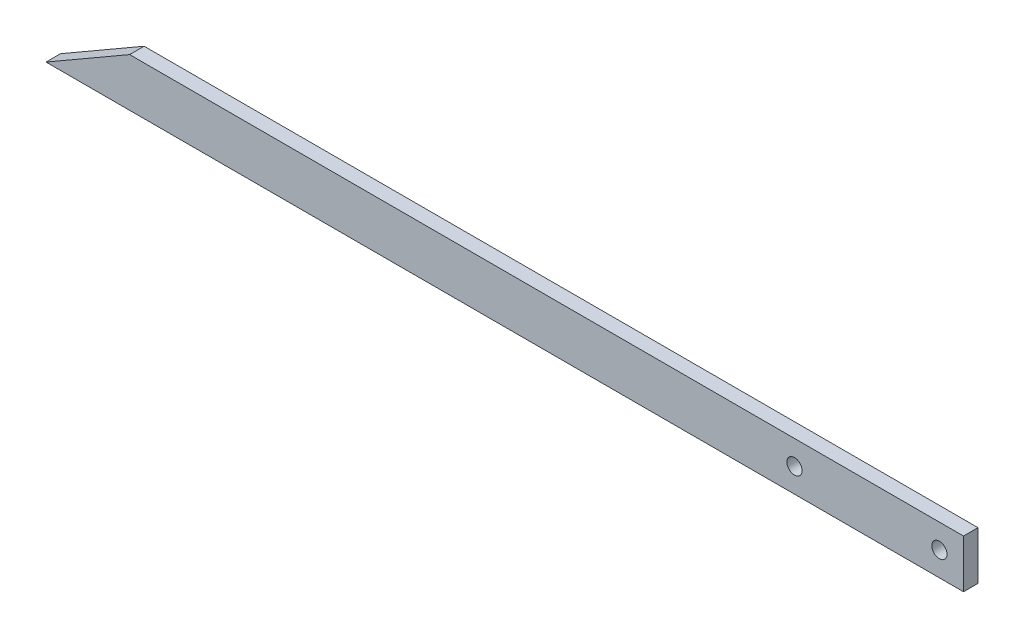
ISO-10303-21;
HEADER;
FILE_DESCRIPTION(('STEP AP214'),'2;1');
FILE_NAME('part.step','',(''),(''),'','','');
FILE_SCHEMA(('AUTOMOTIVE_DESIGN { 1 0 10303 214 1 1 1 1 }'));
ENDSEC;
DATA;
#1=APPLICATION_CONTEXT('core data for automotive mechanical design processes');
#2=APPLICATION_PROTOCOL_DEFINITION('international standard','automotive_design',2000,#1);
#3=PRODUCT_CONTEXT('',#1,'mechanical');
#4=PRODUCT('Part','Part','',(#3));
#5=PRODUCT_RELATED_PRODUCT_CATEGORY('part','',(#4));
#6=PRODUCT_DEFINITION_FORMATION('','',#4);
#7=PRODUCT_DEFINITION_CONTEXT('part definition',#1,'design');
#8=PRODUCT_DEFINITION('design','',#6,#7);
#9=PRODUCT_DEFINITION_SHAPE('','',#8);
#10=(LENGTH_UNIT() NAMED_UNIT(*) SI_UNIT(.MILLI.,.METRE.));
#11=(NAMED_UNIT(*) PLANE_ANGLE_UNIT() SI_UNIT($,.RADIAN.));
#12=(NAMED_UNIT(*) SI_UNIT($,.STERADIAN.) SOLID_ANGLE_UNIT());
#13=UNCERTAINTY_MEASURE_WITH_UNIT(LENGTH_MEASURE(1.E-05),#10,'distance_accuracy_value','');
#14=(GEOMETRIC_REPRESENTATION_CONTEXT(3) GLOBAL_UNCERTAINTY_ASSIGNED_CONTEXT((#13)) GLOBAL_UNIT_ASSIGNED_CONTEXT((#10,
#11,#12)) REPRESENTATION_CONTEXT('',''));
#15=CARTESIAN_POINT('',(0.,0.,0.));
#16=DIRECTION('',(0.,0.,1.));
#17=DIRECTION('',(1.,0.,0.));
#18=AXIS2_PLACEMENT_3D('',#15,#16,#17);
#19=CARTESIAN_POINT('',(0.,0.,7.62));
#20=DIRECTION('',(0.,1.,0.));
#21=DIRECTION('',(0.,0.,1.));
#22=AXIS2_PLACEMENT_3D('',#19,#20,#21);
#23=PLANE('',#22);
#24=DIRECTION('',(1.,0.,0.));
#25=VECTOR('',#24,1.);
#26=CARTESIAN_POINT('',(0.,0.,0.));
#27=LINE('',#26,#25);
#28=CARTESIAN_POINT('',(0.,0.,0.));
#29=VERTEX_POINT('',#28);
#30=CARTESIAN_POINT('',(482.6,0.,0.));
#31=VERTEX_POINT('',#30);
#32=EDGE_CURVE('E111',#29,#31,#27,.T.);
#33=ORIENTED_EDGE('',*,*,#32,.T.);
#34=DIRECTION('',(0.,0.,-1.));
#35=VECTOR('',#34,1.);
#36=CARTESIAN_POINT('',(482.6,0.,7.62));
#37=LINE('',#36,#35);
#38=CARTESIAN_POINT('',(482.6,0.,7.62));
#39=VERTEX_POINT('',#38);
#40=EDGE_CURVE('E11',#39,#31,#37,.T.);
#41=ORIENTED_EDGE('',*,*,#40,.F.);
#42=DIRECTION('',(1.,0.,0.));
#43=VECTOR('',#42,1.);
#44=CARTESIAN_POINT('',(0.,0.,7.62));
#45=LINE('',#44,#43);
#46=CARTESIAN_POINT('',(0.,0.,7.62));
#47=VERTEX_POINT('',#46);
#48=EDGE_CURVE('E95',#47,#39,#45,.T.);
#49=ORIENTED_EDGE('',*,*,#48,.F.);
#50=DIRECTION('',(0.,0.,-1.));
#51=VECTOR('',#50,1.);
#52=CARTESIAN_POINT('',(0.,0.,7.62));
#53=LINE('',#52,#51);
#54=EDGE_CURVE('E107',#47,#29,#53,.T.);
#55=ORIENTED_EDGE('',*,*,#54,.T.);
#56=EDGE_LOOP('',(#33,#41,#49,#55));
#57=FACE_BOUND('',#56,.T.);
#58=ADVANCED_FACE('F43',(#57),#23,.F.);
#59=CARTESIAN_POINT('',(482.6,0.,7.62));
#60=DIRECTION('',(-1.,0.,0.));
#61=DIRECTION('',(0.,0.,1.));
#62=AXIS2_PLACEMENT_3D('',#59,#60,#61);
#63=PLANE('',#62);
#64=DIRECTION('',(0.,1.,0.));
#65=VECTOR('',#64,1.);
#66=CARTESIAN_POINT('',(482.6,0.,0.));
#67=LINE('',#66,#65);
#68=CARTESIAN_POINT('',(482.6,25.4,0.));
#69=VERTEX_POINT('',#68);
#70=EDGE_CURVE('E100',#31,#69,#67,.T.);
#71=ORIENTED_EDGE('',*,*,#70,.T.);
#72=DIRECTION('',(0.,0.,-1.));
#73=VECTOR('',#72,1.);
#74=CARTESIAN_POINT('',(482.6,25.4,7.62));
#75=LINE('',#74,#73);
#76=CARTESIAN_POINT('',(482.6,25.4,7.62));
#77=VERTEX_POINT('',#76);
#78=EDGE_CURVE('E52',#77,#69,#75,.T.);
#79=ORIENTED_EDGE('',*,*,#78,.F.);
#80=DIRECTION('',(0.,1.,0.));
#81=VECTOR('',#80,1.);
#82=CARTESIAN_POINT('',(482.6,0.,7.62));
#83=LINE('',#82,#81);
#84=EDGE_CURVE('E90',#39,#77,#83,.T.);
#85=ORIENTED_EDGE('',*,*,#84,.F.);
#86=ORIENTED_EDGE('',*,*,#40,.T.);
#87=EDGE_LOOP('',(#71,#79,#85,#86));
#88=FACE_BOUND('',#87,.T.);
#89=ADVANCED_FACE('F99',(#88),#63,.F.);
#90=CARTESIAN_POINT('',(43.9940905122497,25.4,7.62));
#91=DIRECTION('',(0.,-1.,0.));
#92=DIRECTION('',(0.,0.,-1.));
#93=AXIS2_PLACEMENT_3D('',#90,#91,#92);
#94=PLANE('',#93);
#95=DIRECTION('',(-1.,0.,0.));
#96=VECTOR('',#95,1.);
#97=CARTESIAN_POINT('',(43.9940905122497,25.4,0.));
#98=LINE('',#97,#96);
#99=CARTESIAN_POINT('',(43.9940905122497,25.4,0.));
#100=VERTEX_POINT('',#99);
#101=EDGE_CURVE('E77',#69,#100,#98,.T.);
#102=ORIENTED_EDGE('',*,*,#101,.T.);
#103=DIRECTION('',(0.,0.,-1.));
#104=VECTOR('',#103,1.);
#105=CARTESIAN_POINT('',(43.9940905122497,25.4,7.62));
#106=LINE('',#105,#104);
#107=CARTESIAN_POINT('',(43.9940905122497,25.4,7.62));
#108=VERTEX_POINT('',#107);
#109=EDGE_CURVE('E102',#108,#100,#106,.T.);
#110=ORIENTED_EDGE('',*,*,#109,.F.);
#111=DIRECTION('',(-1.,0.,0.));
#112=VECTOR('',#111,1.);
#113=CARTESIAN_POINT('',(43.9940905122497,25.4,7.62));
#114=LINE('',#113,#112);
#115=EDGE_CURVE('E93',#77,#108,#114,.T.);
#116=ORIENTED_EDGE('',*,*,#115,.F.);
#117=ORIENTED_EDGE('',*,*,#78,.T.);
#118=EDGE_LOOP('',(#102,#110,#116,#117));
#119=FACE_BOUND('',#118,.T.);
#120=ADVANCED_FACE('F103',(#119),#94,.F.);
#121=CARTESIAN_POINT('',(0.,0.,7.62));
#122=DIRECTION('',(0.499999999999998,-0.86602540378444,0.));
#123=DIRECTION('',(0.86602540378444,0.499999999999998,0.));
#124=AXIS2_PLACEMENT_3D('',#121,#122,#123);
#125=PLANE('',#124);
#126=DIRECTION('',(-0.86602540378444,-0.499999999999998,0.));
#127=VECTOR('',#126,1.);
#128=CARTESIAN_POINT('',(0.,0.,0.));
#129=LINE('',#128,#127);
#130=EDGE_CURVE('E83',#100,#29,#129,.T.);
#131=ORIENTED_EDGE('',*,*,#130,.T.);
#132=ORIENTED_EDGE('',*,*,#54,.F.);
#133=DIRECTION('',(-0.86602540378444,-0.499999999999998,0.));
#134=VECTOR('',#133,1.);
#135=CARTESIAN_POINT('',(0.,0.,7.62));
#136=LINE('',#135,#134);
#137=EDGE_CURVE('E60',#108,#47,#136,.T.);
#138=ORIENTED_EDGE('',*,*,#137,.F.);
#139=ORIENTED_EDGE('',*,*,#109,.T.);
#140=EDGE_LOOP('',(#131,#132,#138,#139));
#141=FACE_BOUND('',#140,.T.);
#142=ADVANCED_FACE('F125',(#141),#125,.F.);
#143=CARTESIAN_POINT('',(0.,0.,7.62));
#144=DIRECTION('',(0.,0.,1.));
#145=DIRECTION('',(1.,0.,0.));
#146=AXIS2_PLACEMENT_3D('',#143,#144,#145);
#147=PLANE('',#146);
#148=CARTESIAN_POINT('',(469.9,12.7,7.62));
#149=DIRECTION('',(0.,0.,1.));
#150=DIRECTION('',(1.,0.,0.));
#151=AXIS2_PLACEMENT_3D('',#148,#149,#150);
#152=CIRCLE('',#151,3.99999999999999);
#153=CARTESIAN_POINT('',(473.9,12.7,7.62));
#154=VERTEX_POINT('',#153);
#155=EDGE_CURVE('E140',#154,#154,#152,.T.);
#156=ORIENTED_EDGE('',*,*,#155,.F.);
#157=EDGE_LOOP('',(#156));
#158=FACE_BOUND('',#157,.T.);
#159=CARTESIAN_POINT('',(393.7,12.7,7.62));
#160=DIRECTION('',(0.,0.,1.));
#161=DIRECTION('',(1.,0.,0.));
#162=AXIS2_PLACEMENT_3D('',#159,#160,#161);
#163=CIRCLE('',#162,3.99999999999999);
#164=CARTESIAN_POINT('',(397.7,12.7,7.62));
#165=VERTEX_POINT('',#164);
#166=EDGE_CURVE('E136',#165,#165,#163,.T.);
#167=ORIENTED_EDGE('',*,*,#166,.F.);
#168=EDGE_LOOP('',(#167));
#169=FACE_BOUND('',#168,.T.);
#170=ORIENTED_EDGE('',*,*,#48,.T.);
#171=ORIENTED_EDGE('',*,*,#84,.T.);
#172=ORIENTED_EDGE('',*,*,#115,.T.);
#173=ORIENTED_EDGE('',*,*,#137,.T.);
#174=EDGE_LOOP('',(#170,#171,#172,#173));
#175=FACE_BOUND('',#174,.T.);
#176=ADVANCED_FACE('F91',(#158,#169,#175),#147,.T.);
#177=CARTESIAN_POINT('',(0.,0.,0.));
#178=DIRECTION('',(0.,0.,1.));
#179=DIRECTION('',(1.,0.,0.));
#180=AXIS2_PLACEMENT_3D('',#177,#178,#179);
#181=PLANE('',#180);
#182=CARTESIAN_POINT('',(469.9,12.7,0.));
#183=DIRECTION('',(0.,0.,1.));
#184=DIRECTION('',(1.,0.,0.));
#185=AXIS2_PLACEMENT_3D('',#182,#183,#184);
#186=CIRCLE('',#185,3.99999999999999);
#187=CARTESIAN_POINT('',(473.9,12.7,0.));
#188=VERTEX_POINT('',#187);
#189=EDGE_CURVE('E115',#188,#188,#186,.T.);
#190=ORIENTED_EDGE('',*,*,#189,.T.);
#191=EDGE_LOOP('',(#190));
#192=FACE_BOUND('',#191,.T.);
#193=CARTESIAN_POINT('',(393.7,12.7,0.));
#194=DIRECTION('',(0.,0.,1.));
#195=DIRECTION('',(1.,0.,0.));
#196=AXIS2_PLACEMENT_3D('',#193,#194,#195);
#197=CIRCLE('',#196,3.99999999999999);
#198=CARTESIAN_POINT('',(397.7,12.7,0.));
#199=VERTEX_POINT('',#198);
#200=EDGE_CURVE('E132',#199,#199,#197,.T.);
#201=ORIENTED_EDGE('',*,*,#200,.T.);
#202=EDGE_LOOP('',(#201));
#203=FACE_BOUND('',#202,.T.);
#204=ORIENTED_EDGE('',*,*,#32,.F.);
#205=ORIENTED_EDGE('',*,*,#130,.F.);
#206=ORIENTED_EDGE('',*,*,#101,.F.);
#207=ORIENTED_EDGE('',*,*,#70,.F.);
#208=EDGE_LOOP('',(#204,#205,#206,#207));
#209=FACE_BOUND('',#208,.T.);
#210=ADVANCED_FACE('F128',(#192,#203,#209),#181,.F.);
#211=CARTESIAN_POINT('',(393.7,12.7,0.));
#212=DIRECTION('',(0.,0.,1.));
#213=DIRECTION('',(1.,0.,0.));
#214=AXIS2_PLACEMENT_3D('',#211,#212,#213);
#215=CYLINDRICAL_SURFACE('',#214,3.99999999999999);
#216=CARTESIAN_POINT('',(397.7,12.7,0.));
#217=CARTESIAN_POINT('',(397.7,12.7,0.0793749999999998));
#218=CARTESIAN_POINT('',(397.7,12.7,0.15875));
#219=CARTESIAN_POINT('',(397.7,12.7,0.3175));
#220=CARTESIAN_POINT('',(397.7,12.7,0.396875));
#221=CARTESIAN_POINT('',(397.7,12.7,0.555625));
#222=CARTESIAN_POINT('',(397.7,12.7,0.635));
#223=CARTESIAN_POINT('',(397.7,12.7,0.79375));
#224=CARTESIAN_POINT('',(397.7,12.7,0.873125));
#225=CARTESIAN_POINT('',(397.7,12.7,1.031875));
#226=CARTESIAN_POINT('',(397.7,12.7,1.11125));
#227=CARTESIAN_POINT('',(397.7,12.7,1.27));
#228=CARTESIAN_POINT('',(397.7,12.7,1.349375));
#229=CARTESIAN_POINT('',(397.7,12.7,1.508125));
#230=CARTESIAN_POINT('',(397.7,12.7,1.5875));
#231=CARTESIAN_POINT('',(397.7,12.7,1.74625));
#232=CARTESIAN_POINT('',(397.7,12.7,1.825625));
#233=CARTESIAN_POINT('',(397.7,12.7,1.984375));
#234=CARTESIAN_POINT('',(397.7,12.7,2.06375));
#235=CARTESIAN_POINT('',(397.7,12.7,2.2225));
#236=CARTESIAN_POINT('',(397.7,12.7,2.301875));
#237=CARTESIAN_POINT('',(397.7,12.7,2.460625));
#238=CARTESIAN_POINT('',(397.7,12.7,2.54));
#239=CARTESIAN_POINT('',(397.7,12.7,2.69875));
#240=CARTESIAN_POINT('',(397.7,12.7,2.778125));
#241=CARTESIAN_POINT('',(397.7,12.7,2.936875));
#242=CARTESIAN_POINT('',(397.7,12.7,3.01625));
#243=CARTESIAN_POINT('',(397.7,12.7,3.175));
#244=CARTESIAN_POINT('',(397.7,12.7,3.254375));
#245=CARTESIAN_POINT('',(397.7,12.7,3.413125));
#246=CARTESIAN_POINT('',(397.7,12.7,3.4925));
#247=CARTESIAN_POINT('',(397.7,12.7,3.65125));
#248=CARTESIAN_POINT('',(397.7,12.7,3.730625));
#249=CARTESIAN_POINT('',(397.7,12.7,3.889375));
#250=CARTESIAN_POINT('',(397.7,12.7,3.96875));
#251=CARTESIAN_POINT('',(397.7,12.7,4.1275));
#252=CARTESIAN_POINT('',(397.7,12.7,4.206875));
#253=CARTESIAN_POINT('',(397.7,12.7,4.365625));
#254=CARTESIAN_POINT('',(397.7,12.7,4.445));
#255=CARTESIAN_POINT('',(397.7,12.7,4.60375));
#256=CARTESIAN_POINT('',(397.7,12.7,4.683125));
#257=CARTESIAN_POINT('',(397.7,12.7,4.841875));
#258=CARTESIAN_POINT('',(397.7,12.7,4.92125));
#259=CARTESIAN_POINT('',(397.7,12.7,5.08));
#260=CARTESIAN_POINT('',(397.7,12.7,5.159375));
#261=CARTESIAN_POINT('',(397.7,12.7,5.318125));
#262=CARTESIAN_POINT('',(397.7,12.7,5.3975));
#263=CARTESIAN_POINT('',(397.7,12.7,5.55625));
#264=CARTESIAN_POINT('',(397.7,12.7,5.635625));
#265=CARTESIAN_POINT('',(397.7,12.7,5.794375));
#266=CARTESIAN_POINT('',(397.7,12.7,5.87375));
#267=CARTESIAN_POINT('',(397.7,12.7,6.0325));
#268=CARTESIAN_POINT('',(397.7,12.7,6.111875));
#269=CARTESIAN_POINT('',(397.7,12.7,6.270625));
#270=CARTESIAN_POINT('',(397.7,12.7,6.35));
#271=CARTESIAN_POINT('',(397.7,12.7,6.50875));
#272=CARTESIAN_POINT('',(397.7,12.7,6.588125));
#273=CARTESIAN_POINT('',(397.7,12.7,6.746875));
#274=CARTESIAN_POINT('',(397.7,12.7,6.82625));
#275=CARTESIAN_POINT('',(397.7,12.7,6.985));
#276=CARTESIAN_POINT('',(397.7,12.7,7.064375));
#277=CARTESIAN_POINT('',(397.7,12.7,7.223125));
#278=CARTESIAN_POINT('',(397.7,12.7,7.3025));
#279=CARTESIAN_POINT('',(397.7,12.7,7.46125));
#280=CARTESIAN_POINT('',(397.7,12.7,7.540625));
#281=CARTESIAN_POINT('',(397.7,12.7,7.62));
#282=B_SPLINE_CURVE_WITH_KNOTS('',3,(#216,#217,#218,#219,#220,#221,#222,#223,#224,#225,#226,
#227,#228,#229,#230,#231,#232,#233,#234,#235,#236,#237,#238,#239,#240,#241,#242,#243,#244,#245,
#246,#247,#248,#249,#250,#251,#252,#253,#254,#255,#256,#257,#258,#259,#260,#261,#262,#263,#264,
#265,#266,#267,#268,#269,#270,#271,#272,#273,#274,#275,#276,#277,#278,#279,#280,#281),
.UNSPECIFIED.,.F.,.F.,(4,2,2,2,2,2,2,2,2,2,2,2,2,2,2,2,2,2,2,2,2,2,2,2,2,2,2,2,2,2,2,2,4),(0.,
0.238125,0.47625,0.714375,0.9525,1.190625,1.42875,1.666875,1.905,2.143125,2.38125,2.619375,
2.8575,3.095625,3.33375,3.571875,3.81,4.048125,4.28625,4.524375,4.7625,5.000625,5.23875,
5.476875,5.715,5.953125,6.19125,6.429375,6.6675,6.905625,7.14375,7.381875,7.62),.UNSPECIFIED.);
#283=EDGE_CURVE('BSEAM153',#199,#165,#282,.T.);
#284=ORIENTED_EDGE('',*,*,#200,.F.);
#285=ORIENTED_EDGE('',*,*,#166,.T.);
#286=ORIENTED_EDGE('',*,*,#283,.T.);
#287=ORIENTED_EDGE('',*,*,#283,.F.);
#288=EDGE_LOOP('',(#284,#286,#285,#287));
#289=FACE_BOUND('',#288,.T.);
#290=ADVANCED_FACE('F153',(#289),#215,.F.);
#291=CARTESIAN_POINT('',(469.9,12.7,0.));
#292=DIRECTION('',(0.,0.,1.));
#293=DIRECTION('',(1.,0.,0.));
#294=AXIS2_PLACEMENT_3D('',#291,#292,#293);
#295=CYLINDRICAL_SURFACE('',#294,3.99999999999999);
#296=CARTESIAN_POINT('',(473.9,12.7,0.));
#297=CARTESIAN_POINT('',(473.9,12.7,0.0793749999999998));
#298=CARTESIAN_POINT('',(473.9,12.7,0.15875));
#299=CARTESIAN_POINT('',(473.9,12.7,0.3175));
#300=CARTESIAN_POINT('',(473.9,12.7,0.396875));
#301=CARTESIAN_POINT('',(473.9,12.7,0.555625));
#302=CARTESIAN_POINT('',(473.9,12.7,0.635));
#303=CARTESIAN_POINT('',(473.9,12.7,0.79375));
#304=CARTESIAN_POINT('',(473.9,12.7,0.873125));
#305=CARTESIAN_POINT('',(473.9,12.7,1.031875));
#306=CARTESIAN_POINT('',(473.9,12.7,1.11125));
#307=CARTESIAN_POINT('',(473.9,12.7,1.27));
#308=CARTESIAN_POINT('',(473.9,12.7,1.349375));
#309=CARTESIAN_POINT('',(473.9,12.7,1.508125));
#310=CARTESIAN_POINT('',(473.9,12.7,1.5875));
#311=CARTESIAN_POINT('',(473.9,12.7,1.74625));
#312=CARTESIAN_POINT('',(473.9,12.7,1.825625));
#313=CARTESIAN_POINT('',(473.9,12.7,1.984375));
#314=CARTESIAN_POINT('',(473.9,12.7,2.06375));
#315=CARTESIAN_POINT('',(473.9,12.7,2.2225));
#316=CARTESIAN_POINT('',(473.9,12.7,2.301875));
#317=CARTESIAN_POINT('',(473.9,12.7,2.460625));
#318=CARTESIAN_POINT('',(473.9,12.7,2.54));
#319=CARTESIAN_POINT('',(473.9,12.7,2.69875));
#320=CARTESIAN_POINT('',(473.9,12.7,2.778125));
#321=CARTESIAN_POINT('',(473.9,12.7,2.936875));
#322=CARTESIAN_POINT('',(473.9,12.7,3.01625));
#323=CARTESIAN_POINT('',(473.9,12.7,3.175));
#324=CARTESIAN_POINT('',(473.9,12.7,3.254375));
#325=CARTESIAN_POINT('',(473.9,12.7,3.413125));
#326=CARTESIAN_POINT('',(473.9,12.7,3.4925));
#327=CARTESIAN_POINT('',(473.9,12.7,3.65125));
#328=CARTESIAN_POINT('',(473.9,12.7,3.730625));
#329=CARTESIAN_POINT('',(473.9,12.7,3.889375));
#330=CARTESIAN_POINT('',(473.9,12.7,3.96875));
#331=CARTESIAN_POINT('',(473.9,12.7,4.1275));
#332=CARTESIAN_POINT('',(473.9,12.7,4.206875));
#333=CARTESIAN_POINT('',(473.9,12.7,4.365625));
#334=CARTESIAN_POINT('',(473.9,12.7,4.445));
#335=CARTESIAN_POINT('',(473.9,12.7,4.60375));
#336=CARTESIAN_POINT('',(473.9,12.7,4.683125));
#337=CARTESIAN_POINT('',(473.9,12.7,4.841875));
#338=CARTESIAN_POINT('',(473.9,12.7,4.92125));
#339=CARTESIAN_POINT('',(473.9,12.7,5.08));
#340=CARTESIAN_POINT('',(473.9,12.7,5.159375));
#341=CARTESIAN_POINT('',(473.9,12.7,5.318125));
#342=CARTESIAN_POINT('',(473.9,12.7,5.3975));
#343=CARTESIAN_POINT('',(473.9,12.7,5.55625));
#344=CARTESIAN_POINT('',(473.9,12.7,5.635625));
#345=CARTESIAN_POINT('',(473.9,12.7,5.794375));
#346=CARTESIAN_POINT('',(473.9,12.7,5.87375));
#347=CARTESIAN_POINT('',(473.9,12.7,6.0325));
#348=CARTESIAN_POINT('',(473.9,12.7,6.111875));
#349=CARTESIAN_POINT('',(473.9,12.7,6.270625));
#350=CARTESIAN_POINT('',(473.9,12.7,6.35));
#351=CARTESIAN_POINT('',(473.9,12.7,6.50875));
#352=CARTESIAN_POINT('',(473.9,12.7,6.588125));
#353=CARTESIAN_POINT('',(473.9,12.7,6.746875));
#354=CARTESIAN_POINT('',(473.9,12.7,6.82625));
#355=CARTESIAN_POINT('',(473.9,12.7,6.985));
#356=CARTESIAN_POINT('',(473.9,12.7,7.064375));
#357=CARTESIAN_POINT('',(473.9,12.7,7.223125));
#358=CARTESIAN_POINT('',(473.9,12.7,7.3025));
#359=CARTESIAN_POINT('',(473.9,12.7,7.46125));
#360=CARTESIAN_POINT('',(473.9,12.7,7.540625));
#361=CARTESIAN_POINT('',(473.9,12.7,7.62));
#362=B_SPLINE_CURVE_WITH_KNOTS('',3,(#296,#297,#298,#299,#300,#301,#302,#303,#304,#305,#306,
#307,#308,#309,#310,#311,#312,#313,#314,#315,#316,#317,#318,#319,#320,#321,#322,#323,#324,#325,
#326,#327,#328,#329,#330,#331,#332,#333,#334,#335,#336,#337,#338,#339,#340,#341,#342,#343,#344,
#345,#346,#347,#348,#349,#350,#351,#352,#353,#354,#355,#356,#357,#358,#359,#360,#361),
.UNSPECIFIED.,.F.,.F.,(4,2,2,2,2,2,2,2,2,2,2,2,2,2,2,2,2,2,2,2,2,2,2,2,2,2,2,2,2,2,2,2,4),(0.,
0.238125,0.47625,0.714375,0.9525,1.190625,1.42875,1.666875,1.905,2.143125,2.38125,2.619375,
2.8575,3.095625,3.33375,3.571875,3.81,4.048125,4.28625,4.524375,4.7625,5.000625,5.23875,
5.476875,5.715,5.953125,6.19125,6.429375,6.6675,6.905625,7.14375,7.381875,7.62),.UNSPECIFIED.);
#363=EDGE_CURVE('BSEAM150',#188,#154,#362,.T.);
#364=ORIENTED_EDGE('',*,*,#189,.F.);
#365=ORIENTED_EDGE('',*,*,#155,.T.);
#366=ORIENTED_EDGE('',*,*,#363,.T.);
#367=ORIENTED_EDGE('',*,*,#363,.F.);
#368=EDGE_LOOP('',(#364,#366,#365,#367));
#369=FACE_BOUND('',#368,.T.);
#370=ADVANCED_FACE('F150',(#369),#295,.F.);
#371=CLOSED_SHELL('',(#58,#89,#120,#142,#176,#210,#290,#370));
#372=MANIFOLD_SOLID_BREP('B2',#371);
#373=ADVANCED_BREP_SHAPE_REPRESENTATION('',(#18,#372),#14);
#374=SHAPE_DEFINITION_REPRESENTATION(#9,#373);
ENDSEC;
END-ISO-10303-21;
